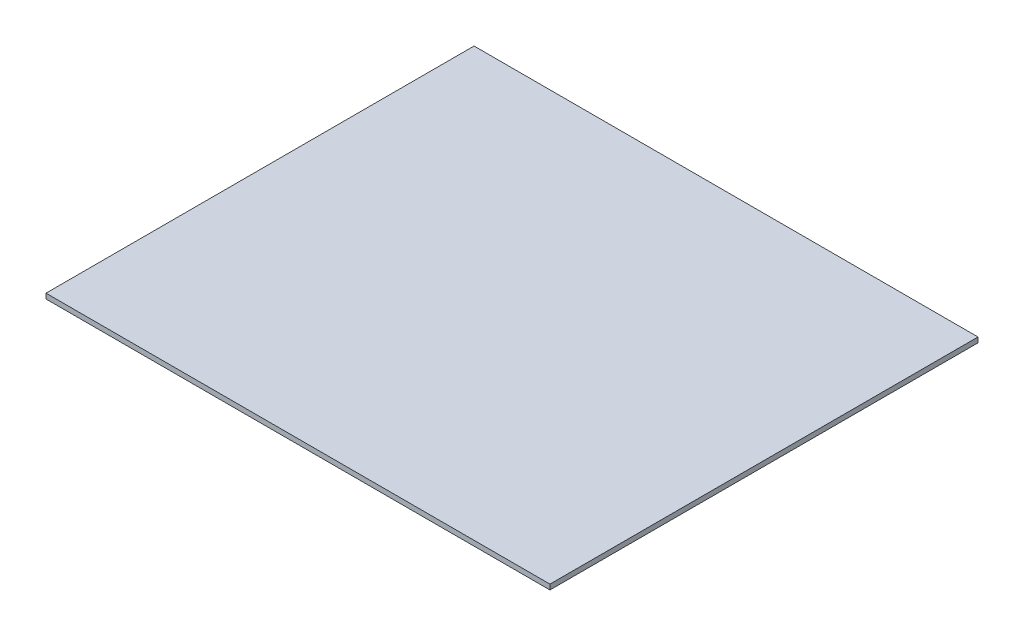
from build123d import *

# Parameters (mm, degrees)
EXTRUSION1_DEPTH      = 100
EXTRUSION1_DEPTH_BACK = 100
ESQUISSE1_W           = 235.457667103
ESQUISSE1_H           = 2.380209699


with BuildPart() as part:
    # Esquisse1 → Extrusion1 (new, two sides: drawn at the far end of the back side and taken through both)
    with BuildSketch(Plane.XY.offset(-EXTRUSION1_DEPTH_BACK)):
        with Locations((12.816513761, -1.19010485)):
            Rectangle(ESQUISSE1_W, ESQUISSE1_H)
    extrude(amount=EXTRUSION1_DEPTH + EXTRUSION1_DEPTH_BACK)


solid = part.part
